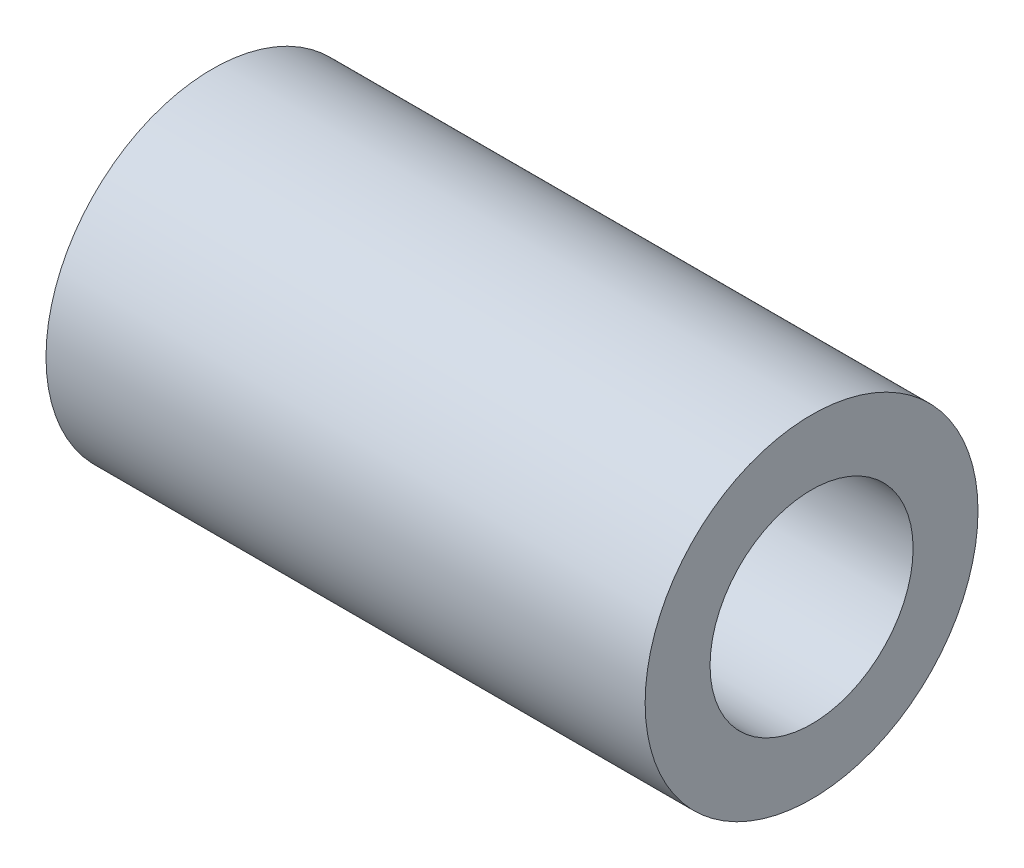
from build123d import *

# Parameters (mm, degrees)
SKETCH1_R           = 5
SKETCH1_R_2         = 3.05
BOSS_EXTRUDE1_DEPTH = 18


with BuildPart() as part:
    # Sketch1 → Boss-Extrude1 (new body)
    with BuildSketch(Plane(origin=(0, 0, 0), x_dir=(0, 0, -1), z_dir=(1, 0, 0))):
        Circle(SKETCH1_R)
        Circle(SKETCH1_R_2, mode=Mode.SUBTRACT)
    extrude(amount=BOSS_EXTRUDE1_DEPTH)


solid = part.part
